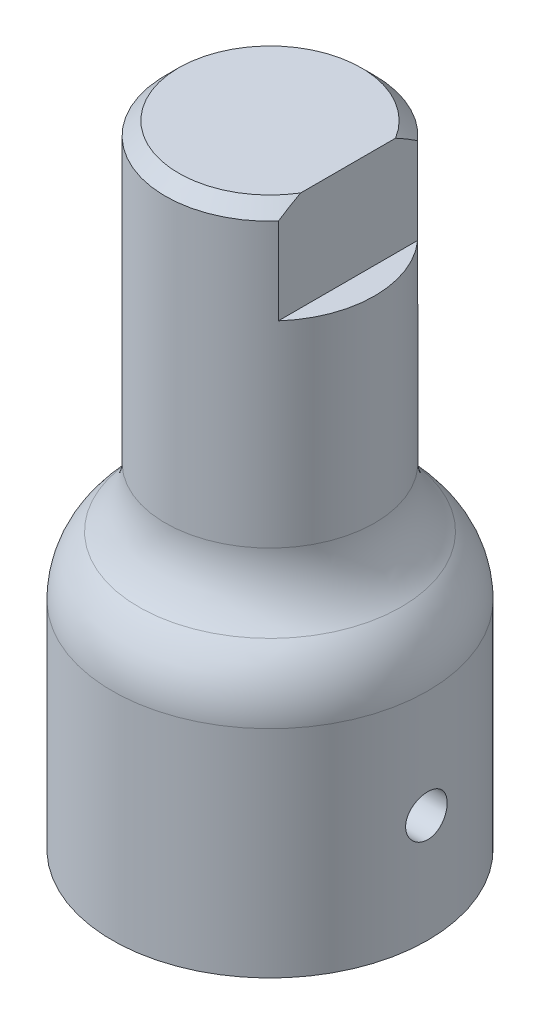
ISO-10303-21;
HEADER;
FILE_DESCRIPTION(('STEP AP214'),'2;1');
FILE_NAME('part.step','',(''),(''),'','','');
FILE_SCHEMA(('AUTOMOTIVE_DESIGN { 1 0 10303 214 1 1 1 1 }'));
ENDSEC;
DATA;
#1=APPLICATION_CONTEXT('core data for automotive mechanical design processes');
#2=APPLICATION_PROTOCOL_DEFINITION('international standard','automotive_design',2000,#1);
#3=PRODUCT_CONTEXT('',#1,'mechanical');
#4=PRODUCT('Part','Part','',(#3));
#5=PRODUCT_RELATED_PRODUCT_CATEGORY('part','',(#4));
#6=PRODUCT_DEFINITION_FORMATION('','',#4);
#7=PRODUCT_DEFINITION_CONTEXT('part definition',#1,'design');
#8=PRODUCT_DEFINITION('design','',#6,#7);
#9=PRODUCT_DEFINITION_SHAPE('','',#8);
#10=(LENGTH_UNIT() NAMED_UNIT(*) SI_UNIT(.MILLI.,.METRE.));
#11=(NAMED_UNIT(*) PLANE_ANGLE_UNIT() SI_UNIT($,.RADIAN.));
#12=(NAMED_UNIT(*) SI_UNIT($,.STERADIAN.) SOLID_ANGLE_UNIT());
#13=UNCERTAINTY_MEASURE_WITH_UNIT(LENGTH_MEASURE(1.E-05),#10,'distance_accuracy_value','');
#14=(GEOMETRIC_REPRESENTATION_CONTEXT(3) GLOBAL_UNCERTAINTY_ASSIGNED_CONTEXT((#13)) GLOBAL_UNIT_ASSIGNED_CONTEXT((#10,
#11,#12)) REPRESENTATION_CONTEXT('',''));
#15=CARTESIAN_POINT('',(0.,0.,0.));
#16=DIRECTION('',(0.,0.,1.));
#17=DIRECTION('',(1.,0.,0.));
#18=AXIS2_PLACEMENT_3D('',#15,#16,#17);
#19=CARTESIAN_POINT('',(4.85,12.7,-4.09878030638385));
#20=DIRECTION('',(1.,0.,0.));
#21=DIRECTION('',(0.,0.,-1.));
#22=AXIS2_PLACEMENT_3D('',#19,#20,#21);
#23=PLANE('',#22);
#24=DIRECTION('',(0.,0.,1.));
#25=VECTOR('',#24,1.);
#26=CARTESIAN_POINT('',(4.84999999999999,0.,-4.09878030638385));
#27=LINE('',#26,#25);
#28=CARTESIAN_POINT('',(4.84999999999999,0.,-4.09878030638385));
#29=VERTEX_POINT('',#28);
#30=CARTESIAN_POINT('',(4.84999999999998,0.,4.09878030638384));
#31=VERTEX_POINT('',#30);
#32=EDGE_CURVE('E107',#29,#31,#27,.T.);
#33=ORIENTED_EDGE('',*,*,#32,.T.);
#34=DIRECTION('',(0.,-1.,0.));
#35=VECTOR('',#34,1.);
#36=CARTESIAN_POINT('',(4.84999999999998,12.7,4.09878030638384));
#37=LINE('',#36,#35);
#38=CARTESIAN_POINT('',(4.84999999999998,12.7,4.09878030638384));
#39=VERTEX_POINT('',#38);
#40=EDGE_CURVE('E102',#39,#31,#37,.T.);
#41=ORIENTED_EDGE('',*,*,#40,.F.);
#42=DIRECTION('',(0.,0.,1.));
#43=VECTOR('',#42,1.);
#44=CARTESIAN_POINT('',(4.85,12.7,-4.09878030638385));
#45=LINE('',#44,#43);
#46=CARTESIAN_POINT('',(4.85,12.7,-4.09878030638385));
#47=VERTEX_POINT('',#46);
#48=EDGE_CURVE('E103',#47,#39,#45,.T.);
#49=ORIENTED_EDGE('',*,*,#48,.F.);
#50=DIRECTION('',(0.,-1.,0.));
#51=VECTOR('',#50,1.);
#52=CARTESIAN_POINT('',(4.85,12.7,-4.09878030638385));
#53=LINE('',#52,#51);
#54=EDGE_CURVE('E91',#47,#29,#53,.T.);
#55=ORIENTED_EDGE('',*,*,#54,.T.);
#56=EDGE_LOOP('',(#33,#41,#49,#55));
#57=FACE_BOUND('',#56,.T.);
#58=CARTESIAN_POINT('',(4.84999999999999,6.50000000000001,0.));
#59=DIRECTION('',(-1.,0.,0.));
#60=DIRECTION('',(0.,0.,1.));
#61=AXIS2_PLACEMENT_3D('',#58,#59,#60);
#62=CIRCLE('',#61,1.25000000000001);
#63=CARTESIAN_POINT('',(4.84999999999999,6.50000000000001,1.25000000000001));
#64=VERTEX_POINT('',#63);
#65=EDGE_CURVE('E219',#64,#64,#62,.T.);
#66=ORIENTED_EDGE('',*,*,#65,.F.);
#67=EDGE_LOOP('',(#66));
#68=FACE_BOUND('',#67,.T.);
#69=ADVANCED_FACE('F46',(#57,#68),#23,.F.);
#70=CARTESIAN_POINT('',(0.,38.,0.));
#71=DIRECTION('',(0.,-1.,0.));
#72=DIRECTION('',(1.,0.,0.));
#73=AXIS2_PLACEMENT_3D('',#70,#71,#72);
#74=CYLINDRICAL_SURFACE('',#73,6.3);
#75=DIRECTION('',(0.,1.,0.));
#76=VECTOR('',#75,1.);
#77=CARTESIAN_POINT('',(4.70000000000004,32.,4.19523539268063));
#78=LINE('',#77,#76);
#79=CARTESIAN_POINT('',(4.70000000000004,32.,4.19523539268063));
#80=VERTEX_POINT('',#79);
#81=CARTESIAN_POINT('',(4.70000000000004,37.2,4.19523539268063));
#82=VERTEX_POINT('',#81);
#83=EDGE_CURVE('E125',#80,#82,#78,.T.);
#84=ORIENTED_EDGE('',*,*,#83,.T.);
#85=CARTESIAN_POINT('',(0.,37.2,0.));
#86=DIRECTION('',(0.,1.,0.));
#87=DIRECTION('',(-1.,0.,0.));
#88=AXIS2_PLACEMENT_3D('',#85,#86,#87);
#89=CIRCLE('',#88,6.3);
#90=CARTESIAN_POINT('',(4.70000000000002,37.2,-4.19523539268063));
#91=VERTEX_POINT('',#90);
#92=EDGE_CURVE('E141',#82,#91,#89,.F.);
#93=ORIENTED_EDGE('',*,*,#92,.T.);
#94=DIRECTION('',(0.,1.,0.));
#95=VECTOR('',#94,1.);
#96=CARTESIAN_POINT('',(4.70000000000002,32.,-4.19523539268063));
#97=LINE('',#96,#95);
#98=CARTESIAN_POINT('',(4.70000000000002,32.,-4.19523539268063));
#99=VERTEX_POINT('',#98);
#100=EDGE_CURVE('E123',#99,#91,#97,.T.);
#101=ORIENTED_EDGE('',*,*,#100,.F.);
#102=CARTESIAN_POINT('',(0.,32.,0.));
#103=DIRECTION('',(0.,1.,0.));
#104=DIRECTION('',(0.,0.,1.));
#105=AXIS2_PLACEMENT_3D('',#102,#103,#104);
#106=CIRCLE('',#105,6.30000000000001);
#107=EDGE_CURVE('E118',#80,#99,#106,.T.);
#108=ORIENTED_EDGE('',*,*,#107,.F.);
#109=EDGE_LOOP('',(#84,#93,#101,#108));
#110=FACE_BOUND('',#109,.T.);
#111=CARTESIAN_POINT('',(0.,20.1554175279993,0.));
#112=DIRECTION('',(0.,-1.,0.));
#113=DIRECTION('',(1.,0.,0.));
#114=AXIS2_PLACEMENT_3D('',#111,#112,#113);
#115=CIRCLE('',#114,6.3);
#116=CARTESIAN_POINT('',(6.30000000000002,20.1554175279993,0.));
#117=VERTEX_POINT('',#116);
#118=EDGE_CURVE('E128',#117,#117,#115,.T.);
#119=ORIENTED_EDGE('',*,*,#118,.F.);
#120=EDGE_LOOP('',(#119));
#121=FACE_BOUND('',#120,.T.);
#122=ADVANCED_FACE('F178',(#110,#121),#74,.T.);
#123=CARTESIAN_POINT('',(6.30000000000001,38.,0.));
#124=DIRECTION('',(0.,1.,0.));
#125=DIRECTION('',(-1.,0.,0.));
#126=AXIS2_PLACEMENT_3D('',#123,#124,#125);
#127=PLANE('',#126);
#128=DIRECTION('',(0.,0.,1.));
#129=VECTOR('',#128,1.);
#130=CARTESIAN_POINT('',(4.7,38.,-4.19523539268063));
#131=LINE('',#130,#129);
#132=CARTESIAN_POINT('',(4.69999999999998,38.,-2.85657137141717));
#133=VERTEX_POINT('',#132);
#134=CARTESIAN_POINT('',(4.69999999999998,38.,2.85657137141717));
#135=VERTEX_POINT('',#134);
#136=EDGE_CURVE('E116',#133,#135,#131,.T.);
#137=ORIENTED_EDGE('',*,*,#136,.F.);
#138=CARTESIAN_POINT('',(0.,38.,0.));
#139=DIRECTION('',(0.,1.,0.));
#140=DIRECTION('',(-1.,0.,0.));
#141=AXIS2_PLACEMENT_3D('',#138,#139,#140);
#142=CIRCLE('',#141,5.50000000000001);
#143=EDGE_CURVE('E13',#133,#135,#142,.T.);
#144=ORIENTED_EDGE('',*,*,#143,.T.);
#145=EDGE_LOOP('',(#137,#144));
#146=FACE_BOUND('',#145,.T.);
#147=ADVANCED_FACE('F175',(#146),#127,.T.);
#148=CARTESIAN_POINT('',(0.,0.,0.));
#149=DIRECTION('',(0.,-1.,0.));
#150=DIRECTION('',(1.,0.,0.));
#151=AXIS2_PLACEMENT_3D('',#148,#149,#150);
#152=PLANE('',#151);
#153=CARTESIAN_POINT('',(0.,0.,0.));
#154=DIRECTION('',(0.,-1.,0.));
#155=DIRECTION('',(0.,0.,-1.));
#156=AXIS2_PLACEMENT_3D('',#153,#154,#155);
#157=CIRCLE('',#156,6.35);
#158=EDGE_CURVE('E97',#31,#29,#157,.T.);
#159=ORIENTED_EDGE('',*,*,#158,.F.);
#160=ORIENTED_EDGE('',*,*,#32,.F.);
#161=EDGE_LOOP('',(#159,#160));
#162=FACE_BOUND('',#161,.T.);
#163=CARTESIAN_POINT('',(0.,0.,0.));
#164=DIRECTION('',(0.,-1.,0.));
#165=DIRECTION('',(1.,0.,0.));
#166=AXIS2_PLACEMENT_3D('',#163,#164,#165);
#167=CIRCLE('',#166,9.5);
#168=CARTESIAN_POINT('',(9.50000000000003,0.,0.));
#169=VERTEX_POINT('',#168);
#170=EDGE_CURVE('E138',#169,#169,#167,.T.);
#171=ORIENTED_EDGE('',*,*,#170,.T.);
#172=EDGE_LOOP('',(#171));
#173=FACE_BOUND('',#172,.T.);
#174=ADVANCED_FACE('F171',(#162,#173),#152,.T.);
#175=CARTESIAN_POINT('',(0.,38.,0.));
#176=DIRECTION('',(0.,-1.,0.));
#177=DIRECTION('',(1.,0.,0.));
#178=AXIS2_PLACEMENT_3D('',#175,#176,#177);
#179=CYLINDRICAL_SURFACE('',#178,9.5);
#180=CARTESIAN_POINT('',(9.5,7.75000000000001,0.));
#181=CARTESIAN_POINT('',(9.49999898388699,7.74999705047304,0.0698891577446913));
#182=CARTESIAN_POINT('',(9.49922063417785,7.74411883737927,0.139821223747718));
#183=CARTESIAN_POINT('',(9.49619052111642,7.7207635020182,0.277737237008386));
#184=CARTESIAN_POINT('',(9.4939372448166,7.70327446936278,0.345719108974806));
#185=CARTESIAN_POINT('',(9.48821096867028,7.65722352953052,0.477718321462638));
#186=CARTESIAN_POINT('',(9.48473881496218,7.62866930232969,0.541738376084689));
#187=CARTESIAN_POINT('',(9.47696034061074,7.56131582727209,0.664066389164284));
#188=CARTESIAN_POINT('',(9.47265415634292,7.52251825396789,0.722375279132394));
#189=CARTESIAN_POINT('',(9.46365868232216,7.43552769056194,0.831991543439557));
#190=CARTESIAN_POINT('',(9.45896744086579,7.38728486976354,0.883259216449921));
#191=CARTESIAN_POINT('',(9.44974620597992,7.28288032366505,0.976995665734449));
#192=CARTESIAN_POINT('',(9.4452162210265,7.22671818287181,1.01946398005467));
#193=CARTESIAN_POINT('',(9.43681128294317,7.10780894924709,1.09454581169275));
#194=CARTESIAN_POINT('',(9.43293884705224,7.04503797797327,1.12712181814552));
#195=CARTESIAN_POINT('',(9.42631346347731,6.91485665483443,1.18125473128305));
#196=CARTESIAN_POINT('',(9.42356046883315,6.84744649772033,1.20281210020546));
#197=CARTESIAN_POINT('',(9.41950447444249,6.71031388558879,1.23417446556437));
#198=CARTESIAN_POINT('',(9.41819317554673,6.64060706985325,1.24404675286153));
#199=CARTESIAN_POINT('',(9.41714370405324,6.50051471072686,1.25196699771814));
#200=CARTESIAN_POINT('',(9.41740546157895,6.43012919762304,1.25001548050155));
#201=CARTESIAN_POINT('',(9.41946493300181,6.29114795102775,1.2343986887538));
#202=CARTESIAN_POINT('',(9.42125290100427,6.22254370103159,1.22080773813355));
#203=CARTESIAN_POINT('',(9.42614812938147,6.08859811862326,1.18241393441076));
#204=CARTESIAN_POINT('',(9.42925541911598,6.02325685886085,1.1576108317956));
#205=CARTESIAN_POINT('',(9.43645015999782,5.89746233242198,1.09741754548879));
#206=CARTESIAN_POINT('',(9.44054057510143,5.83702460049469,1.06199526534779));
#207=CARTESIAN_POINT('',(9.44923842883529,5.7229230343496,0.981592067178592));
#208=CARTESIAN_POINT('',(9.45384589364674,5.66925954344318,0.936610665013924));
#209=CARTESIAN_POINT('',(9.46310196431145,5.56979852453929,0.837955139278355));
#210=CARTESIAN_POINT('',(9.46775061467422,5.52406448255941,0.784216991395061));
#211=CARTESIAN_POINT('',(9.47653227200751,5.44225557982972,0.669793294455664));
#212=CARTESIAN_POINT('',(9.48066527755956,5.40618074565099,0.609107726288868));
#213=CARTESIAN_POINT('',(9.48795293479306,5.34471345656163,0.482461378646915));
#214=CARTESIAN_POINT('',(9.49110720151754,5.31932520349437,0.416498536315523));
#215=CARTESIAN_POINT('',(9.49607856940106,5.28000332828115,0.281195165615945));
#216=CARTESIAN_POINT('',(9.49789573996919,5.26606911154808,0.211854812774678));
#217=CARTESIAN_POINT('',(9.49997910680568,5.25013365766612,0.0723134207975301));
#218=CARTESIAN_POINT('',(9.50025666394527,5.24804500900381,0.00212252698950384));
#219=CARTESIAN_POINT('',(9.49926026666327,5.25562897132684,-0.13760833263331));
#220=CARTESIAN_POINT('',(9.49798634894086,5.26530130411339,-0.207148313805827));
#221=CARTESIAN_POINT('',(9.49403720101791,5.2960600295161,-0.343343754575));
#222=CARTESIAN_POINT('',(9.49136711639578,5.31710451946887,-0.410008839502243));
#223=CARTESIAN_POINT('',(9.48492442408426,5.36996646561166,-0.538863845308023));
#224=CARTESIAN_POINT('',(9.48115177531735,5.40178432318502,-0.601053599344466));
#225=CARTESIAN_POINT('',(9.47289589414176,5.47549971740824,-0.719581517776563));
#226=CARTESIAN_POINT('',(9.4684087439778,5.51745352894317,-0.775884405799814));
#227=CARTESIAN_POINT('',(9.45923747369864,5.61017061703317,-0.88068091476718));
#228=CARTESIAN_POINT('',(9.45455334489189,5.66093428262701,-0.929174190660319));
#229=CARTESIAN_POINT('',(9.4454807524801,5.77021616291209,-1.01728702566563));
#230=CARTESIAN_POINT('',(9.44109434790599,5.82878142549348,-1.05684847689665));
#231=CARTESIAN_POINT('',(9.43314836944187,5.95177683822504,-1.12557262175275));
#232=CARTESIAN_POINT('',(9.42958877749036,6.01620686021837,-1.15473554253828));
#233=CARTESIAN_POINT('',(9.42371371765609,6.14891887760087,-1.20174170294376));
#234=CARTESIAN_POINT('',(9.42139471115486,6.21718929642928,-1.21961716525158));
#235=CARTESIAN_POINT('',(9.41825342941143,6.35579542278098,-1.24364448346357));
#236=CARTESIAN_POINT('',(9.41743107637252,6.42613102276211,-1.24979694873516));
#237=CARTESIAN_POINT('',(9.41737864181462,6.56629260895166,-1.2501916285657));
#238=CARTESIAN_POINT('',(9.41813635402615,6.63611835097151,-1.24452514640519));
#239=CARTESIAN_POINT('',(9.42113236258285,6.77381550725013,-1.22163669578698));
#240=CARTESIAN_POINT('',(9.42337065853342,6.84168692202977,-1.204414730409));
#241=CARTESIAN_POINT('',(9.42907173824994,6.97353349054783,-1.1589336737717));
#242=CARTESIAN_POINT('',(9.4325339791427,7.03751035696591,-1.13067947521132));
#243=CARTESIAN_POINT('',(9.4402936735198,7.15982986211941,-1.06394495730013));
#244=CARTESIAN_POINT('',(9.4445911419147,7.21817240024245,-1.02546445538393));
#245=CARTESIAN_POINT('',(9.45357680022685,7.32803321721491,-0.93903254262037));
#246=CARTESIAN_POINT('',(9.45826764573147,7.37949781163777,-0.891013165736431));
#247=CARTESIAN_POINT('',(9.46748837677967,7.47367272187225,-0.78700917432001));
#248=CARTESIAN_POINT('',(9.47201822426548,7.51638097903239,-0.731022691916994));
#249=CARTESIAN_POINT('',(9.48042783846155,7.59198611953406,-0.612401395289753));
#250=CARTESIAN_POINT('',(9.48430478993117,7.62484096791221,-0.549739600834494));
#251=CARTESIAN_POINT('',(9.49094356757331,7.67951365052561,-0.419770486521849));
#252=CARTESIAN_POINT('',(9.49370659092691,7.70134334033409,-0.352468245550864));
#253=CARTESIAN_POINT('',(9.4971487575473,7.72818726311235,-0.23735722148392));
#254=CARTESIAN_POINT('',(9.49821269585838,7.73635510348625,-0.190270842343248));
#255=CARTESIAN_POINT('',(9.49963866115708,7.74726245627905,-0.0954629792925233));
#256=CARTESIAN_POINT('',(9.50000069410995,7.75000201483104,-0.0477415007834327));
#257=CARTESIAN_POINT('',(9.5,7.75000000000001,0.));
#258=B_SPLINE_CURVE_WITH_KNOTS('',3,(#180,#181,#182,#183,#184,#185,#186,#187,#188,#189,#190,
#191,#192,#193,#194,#195,#196,#197,#198,#199,#200,#201,#202,#203,#204,#205,#206,#207,#208,#209,
#210,#211,#212,#213,#214,#215,#216,#217,#218,#219,#220,#221,#222,#223,#224,#225,#226,#227,#228,
#229,#230,#231,#232,#233,#234,#235,#236,#237,#238,#239,#240,#241,#242,#243,#244,#245,#246,#247,
#248,#249,#250,#251,#252,#253,#254,#255,#256,#257),.UNSPECIFIED.,.T.,.F.,(4,2,2,2,2,2,2,2,2,2,2,
2,2,2,2,2,2,2,2,2,2,2,2,2,2,2,2,2,2,2,2,2,2,2,2,2,2,2,4),(0.,0.209493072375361,0.41920137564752,
0.628764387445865,0.838293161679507,1.048958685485,1.25963526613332,1.47110101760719,
1.68255789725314,1.89279104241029,2.10301484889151,2.31190619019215,2.52080218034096,
2.73033603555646,2.93988050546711,3.1510321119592,3.36218429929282,3.5734194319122,
3.78464359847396,3.99430703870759,4.20396551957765,4.41285669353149,4.62175565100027,
4.8318422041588,5.04193803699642,5.25336364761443,5.46478463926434,5.67559931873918,
5.88640303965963,6.09558430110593,6.30476550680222,6.51385404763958,6.7229463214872,
6.93358560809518,7.14427436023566,7.3558495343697,7.56719671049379,7.71030329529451,
7.8534086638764),.UNSPECIFIED.);
#259=CARTESIAN_POINT('',(9.5,7.75000000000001,0.));
#260=VERTEX_POINT('',#259);
#261=EDGE_CURVE('E114',#260,#260,#258,.T.);
#262=ORIENTED_EDGE('',*,*,#261,.F.);
#263=EDGE_LOOP('',(#262));
#264=FACE_BOUND('',#263,.T.);
#265=CARTESIAN_POINT('',(0.,13.,0.));
#266=DIRECTION('',(0.,-1.,0.));
#267=DIRECTION('',(1.,0.,0.));
#268=AXIS2_PLACEMENT_3D('',#265,#266,#267);
#269=CIRCLE('',#268,9.5);
#270=CARTESIAN_POINT('',(9.50000000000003,13.,0.));
#271=VERTEX_POINT('',#270);
#272=EDGE_CURVE('E135',#271,#271,#269,.T.);
#273=ORIENTED_EDGE('',*,*,#272,.T.);
#274=EDGE_LOOP('',(#273));
#275=FACE_BOUND('',#274,.T.);
#276=ORIENTED_EDGE('',*,*,#170,.F.);
#277=EDGE_LOOP('',(#276));
#278=FACE_BOUND('',#277,.T.);
#279=ADVANCED_FACE('F167',(#264,#275,#278),#179,.T.);
#280=CARTESIAN_POINT('',(0.,13.,0.));
#281=DIRECTION('',(0.,-1.,0.));
#282=DIRECTION('',(1.,0.,0.));
#283=AXIS2_PLACEMENT_3D('',#280,#281,#282);
#284=DEGENERATE_TOROIDAL_SURFACE('',#283,4.7,4.8,.T.);
#285=CARTESIAN_POINT('',(0.,16.5777087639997,0.));
#286=DIRECTION('',(0.,-1.,0.));
#287=DIRECTION('',(1.,0.,0.));
#288=AXIS2_PLACEMENT_3D('',#285,#286,#287);
#289=CIRCLE('',#288,7.9);
#290=CARTESIAN_POINT('',(7.90000000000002,16.5777087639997,0.));
#291=VERTEX_POINT('',#290);
#292=EDGE_CURVE('E132',#291,#291,#289,.T.);
#293=ORIENTED_EDGE('',*,*,#292,.T.);
#294=EDGE_LOOP('',(#293));
#295=FACE_BOUND('',#294,.T.);
#296=ORIENTED_EDGE('',*,*,#272,.F.);
#297=EDGE_LOOP('',(#296));
#298=FACE_BOUND('',#297,.T.);
#299=ADVANCED_FACE('F163',(#295,#298),#284,.T.);
#300=CARTESIAN_POINT('',(0.,20.1554175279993,0.));
#301=DIRECTION('',(0.,-1.,0.));
#302=DIRECTION('',(1.,0.,0.));
#303=AXIS2_PLACEMENT_3D('',#300,#301,#302);
#304=TOROIDAL_SURFACE('',#303,11.1,4.8);
#305=ORIENTED_EDGE('',*,*,#118,.T.);
#306=EDGE_LOOP('',(#305));
#307=FACE_BOUND('',#306,.T.);
#308=ORIENTED_EDGE('',*,*,#292,.F.);
#309=EDGE_LOOP('',(#308));
#310=FACE_BOUND('',#309,.T.);
#311=ADVANCED_FACE('F158',(#307,#310),#304,.F.);
#312=CARTESIAN_POINT('',(4.70000000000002,32.,-4.19523539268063));
#313=DIRECTION('',(-1.,0.,0.));
#314=DIRECTION('',(0.,0.,1.));
#315=AXIS2_PLACEMENT_3D('',#312,#313,#314);
#316=PLANE('',#315);
#317=ORIENTED_EDGE('',*,*,#100,.T.);
#318=CARTESIAN_POINT('',(4.70000000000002,37.2,-4.19523539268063));
#319=CARTESIAN_POINT('',(4.70000000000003,37.2720728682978,-4.08698159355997));
#320=CARTESIAN_POINT('',(4.70000000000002,37.343095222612,-3.97801649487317));
#321=CARTESIAN_POINT('',(4.70000000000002,37.4825614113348,-3.75856132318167));
#322=CARTESIAN_POINT('',(4.70000000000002,37.5510070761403,-3.64807241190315));
#323=CARTESIAN_POINT('',(4.70000000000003,37.684958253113,-3.42529395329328));
#324=CARTESIAN_POINT('',(4.70000000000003,37.7504633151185,-3.31300413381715));
#325=CARTESIAN_POINT('',(4.70000000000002,37.8779972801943,-3.08636367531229));
#326=CARTESIAN_POINT('',(4.70000000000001,37.940023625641,-2.97201159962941));
#327=CARTESIAN_POINT('',(4.69999999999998,38.,-2.85657137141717));
#328=B_SPLINE_CURVE_WITH_KNOTS('',3,(#318,#319,#320,#321,#322,#323,#324,#325,#326,#327),
.UNSPECIFIED.,.F.,.F.,(4,2,2,2,4),(0.,0.390162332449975,0.780042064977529,1.16998128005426,
1.56020352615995),.UNSPECIFIED.);
#329=EDGE_CURVE('E55',#91,#133,#328,.T.);
#330=ORIENTED_EDGE('',*,*,#329,.T.);
#331=ORIENTED_EDGE('',*,*,#136,.T.);
#332=CARTESIAN_POINT('',(4.69999999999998,38.,2.85657137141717));
#333=CARTESIAN_POINT('',(4.70000000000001,37.940023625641,2.97201159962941));
#334=CARTESIAN_POINT('',(4.70000000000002,37.8779972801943,3.08636367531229));
#335=CARTESIAN_POINT('',(4.70000000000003,37.7504633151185,3.31300413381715));
#336=CARTESIAN_POINT('',(4.70000000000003,37.684958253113,3.42529395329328));
#337=CARTESIAN_POINT('',(4.70000000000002,37.5510070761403,3.64807241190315));
#338=CARTESIAN_POINT('',(4.70000000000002,37.4825614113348,3.75856132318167));
#339=CARTESIAN_POINT('',(4.70000000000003,37.343095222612,3.97801649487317));
#340=CARTESIAN_POINT('',(4.70000000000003,37.2720728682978,4.08698159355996));
#341=CARTESIAN_POINT('',(4.70000000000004,37.2,4.19523539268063));
#342=B_SPLINE_CURVE_WITH_KNOTS('',3,(#332,#333,#334,#335,#336,#337,#338,#339,#340,#341),
.UNSPECIFIED.,.F.,.F.,(4,2,2,2,4),(0.,0.390222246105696,0.780161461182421,1.17004119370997,
1.56020352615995),.UNSPECIFIED.);
#343=EDGE_CURVE('E144',#135,#82,#342,.T.);
#344=ORIENTED_EDGE('',*,*,#343,.T.);
#345=ORIENTED_EDGE('',*,*,#83,.F.);
#346=DIRECTION('',(0.,0.,1.));
#347=VECTOR('',#346,1.);
#348=CARTESIAN_POINT('',(4.70000000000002,32.,-4.19523539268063));
#349=LINE('',#348,#347);
#350=EDGE_CURVE('E120',#99,#80,#349,.T.);
#351=ORIENTED_EDGE('',*,*,#350,.F.);
#352=EDGE_LOOP('',(#317,#330,#331,#344,#345,#351));
#353=FACE_BOUND('',#352,.T.);
#354=ADVANCED_FACE('F152',(#353),#316,.F.);
#355=CARTESIAN_POINT('',(0.,32.,0.));
#356=DIRECTION('',(0.,1.,0.));
#357=DIRECTION('',(0.,0.,1.));
#358=AXIS2_PLACEMENT_3D('',#355,#356,#357);
#359=PLANE('',#358);
#360=ORIENTED_EDGE('',*,*,#107,.T.);
#361=ORIENTED_EDGE('',*,*,#350,.T.);
#362=EDGE_LOOP('',(#360,#361));
#363=FACE_BOUND('',#362,.T.);
#364=ADVANCED_FACE('F157',(#363),#359,.T.);
#365=CARTESIAN_POINT('',(0.,12.7,0.));
#366=DIRECTION('',(0.,-1.,0.));
#367=DIRECTION('',(0.,0.,-1.));
#368=AXIS2_PLACEMENT_3D('',#365,#366,#367);
#369=CYLINDRICAL_SURFACE('',#368,6.35);
#370=ORIENTED_EDGE('',*,*,#158,.T.);
#371=ORIENTED_EDGE('',*,*,#54,.F.);
#372=CARTESIAN_POINT('',(0.,12.7,0.));
#373=DIRECTION('',(0.,-1.,0.));
#374=DIRECTION('',(0.,0.,-1.));
#375=AXIS2_PLACEMENT_3D('',#372,#373,#374);
#376=CIRCLE('',#375,6.35);
#377=EDGE_CURVE('E94',#39,#47,#376,.T.);
#378=ORIENTED_EDGE('',*,*,#377,.F.);
#379=ORIENTED_EDGE('',*,*,#40,.T.);
#380=EDGE_LOOP('',(#370,#371,#378,#379));
#381=FACE_BOUND('',#380,.T.);
#382=ADVANCED_FACE('F93',(#381),#369,.F.);
#383=CARTESIAN_POINT('',(0.,12.7,0.));
#384=DIRECTION('',(0.,-1.,0.));
#385=DIRECTION('',(0.,0.,-1.));
#386=AXIS2_PLACEMENT_3D('',#383,#384,#385);
#387=PLANE('',#386);
#388=ORIENTED_EDGE('',*,*,#377,.T.);
#389=ORIENTED_EDGE('',*,*,#48,.T.);
#390=EDGE_LOOP('',(#388,#389));
#391=FACE_BOUND('',#390,.T.);
#392=ADVANCED_FACE('F106',(#391),#387,.T.);
#393=CARTESIAN_POINT('',(4.84999999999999,6.50000000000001,0.));
#394=DIRECTION('',(-1.,0.,0.));
#395=DIRECTION('',(0.,0.,1.));
#396=AXIS2_PLACEMENT_3D('',#393,#394,#395);
#397=CYLINDRICAL_SURFACE('',#396,1.25000000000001);
#398=ORIENTED_EDGE('',*,*,#65,.T.);
#399=EDGE_LOOP('',(#398));
#400=FACE_BOUND('',#399,.T.);
#401=ORIENTED_EDGE('',*,*,#261,.T.);
#402=EDGE_LOOP('',(#401));
#403=FACE_BOUND('',#402,.T.);
#404=ADVANCED_FACE('F209',(#400,#403),#397,.F.);
#405=CARTESIAN_POINT('',(0.,37.2,0.));
#406=DIRECTION('',(0.,-1.,0.));
#407=DIRECTION('',(1.,0.,0.));
#408=AXIS2_PLACEMENT_3D('',#405,#406,#407);
#409=CONICAL_SURFACE('',#408,6.3,0.78539816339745);
#410=ORIENTED_EDGE('',*,*,#343,.F.);
#411=ORIENTED_EDGE('',*,*,#143,.F.);
#412=ORIENTED_EDGE('',*,*,#329,.F.);
#413=ORIENTED_EDGE('',*,*,#92,.F.);
#414=EDGE_LOOP('',(#410,#411,#412,#413));
#415=FACE_BOUND('',#414,.T.);
#416=ADVANCED_FACE('F48',(#415),#409,.T.);
#417=CLOSED_SHELL('',(#69,#122,#147,#174,#279,#299,#311,#354,#364,#382,#392,#404,#416));
#418=MANIFOLD_SOLID_BREP('B2',#417);
#419=ADVANCED_BREP_SHAPE_REPRESENTATION('',(#18,#418),#14);
#420=SHAPE_DEFINITION_REPRESENTATION(#9,#419);
ENDSEC;
END-ISO-10303-21;
